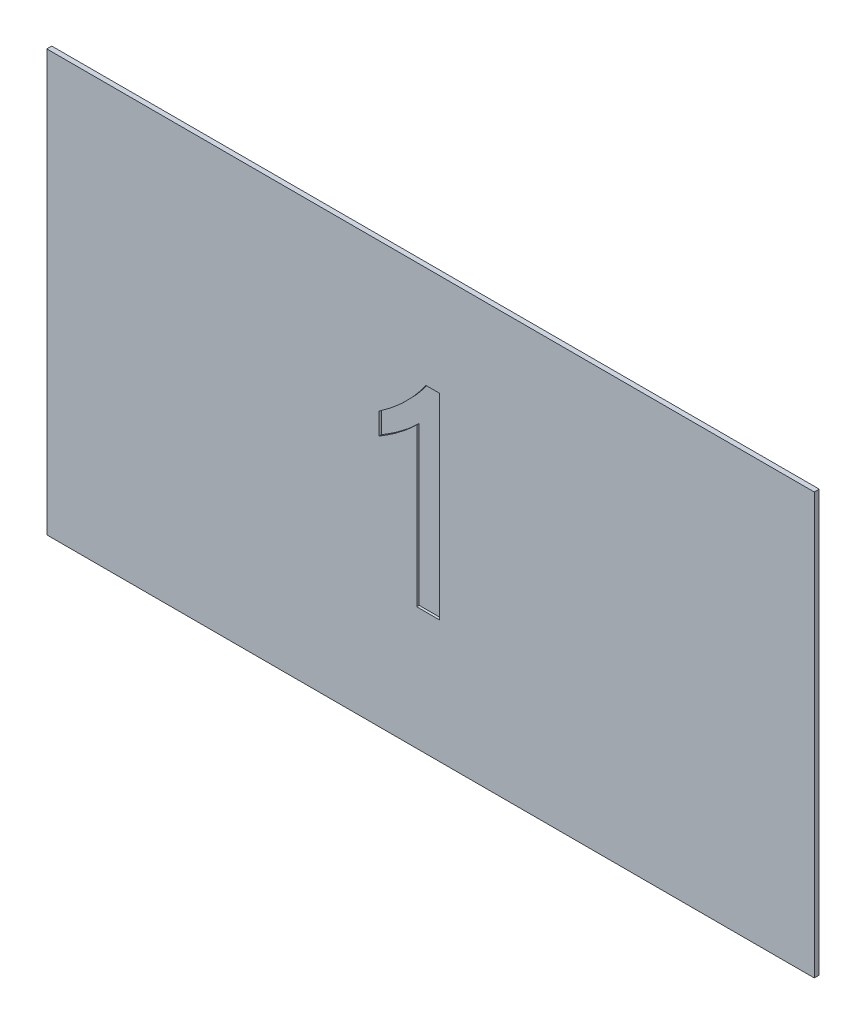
ISO-10303-21;
HEADER;
FILE_DESCRIPTION(('STEP AP214'),'2;1');
FILE_NAME('part.step','',(''),(''),'','','');
FILE_SCHEMA(('AUTOMOTIVE_DESIGN { 1 0 10303 214 1 1 1 1 }'));
ENDSEC;
DATA;
#1=APPLICATION_CONTEXT('core data for automotive mechanical design processes');
#2=APPLICATION_PROTOCOL_DEFINITION('international standard','automotive_design',2000,#1);
#3=PRODUCT_CONTEXT('',#1,'mechanical');
#4=PRODUCT('Part','Part','',(#3));
#5=PRODUCT_RELATED_PRODUCT_CATEGORY('part','',(#4));
#6=PRODUCT_DEFINITION_FORMATION('','',#4);
#7=PRODUCT_DEFINITION_CONTEXT('part definition',#1,'design');
#8=PRODUCT_DEFINITION('design','',#6,#7);
#9=PRODUCT_DEFINITION_SHAPE('','',#8);
#10=(LENGTH_UNIT() NAMED_UNIT(*) SI_UNIT(.MILLI.,.METRE.));
#11=(NAMED_UNIT(*) PLANE_ANGLE_UNIT() SI_UNIT($,.RADIAN.));
#12=(NAMED_UNIT(*) SI_UNIT($,.STERADIAN.) SOLID_ANGLE_UNIT());
#13=UNCERTAINTY_MEASURE_WITH_UNIT(LENGTH_MEASURE(1.E-05),#10,'distance_accuracy_value','');
#14=(GEOMETRIC_REPRESENTATION_CONTEXT(3) GLOBAL_UNCERTAINTY_ASSIGNED_CONTEXT((#13)) GLOBAL_UNIT_ASSIGNED_CONTEXT((#10,
#11,#12)) REPRESENTATION_CONTEXT('',''));
#15=CARTESIAN_POINT('',(0.,0.,0.));
#16=DIRECTION('',(0.,0.,1.));
#17=DIRECTION('',(1.,0.,0.));
#18=AXIS2_PLACEMENT_3D('',#15,#16,#17);
#19=CARTESIAN_POINT('',(-1.28168175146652,2.19572700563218,0.1));
#20=DIRECTION('',(0.,0.,1.));
#21=DIRECTION('',(0.,-1.,0.));
#22=AXIS2_PLACEMENT_3D('',#19,#20,#21);
#23=PLANE('',#22);
#24=DIRECTION('',(0.,1.,0.));
#25=VECTOR('',#24,1.);
#26=CARTESIAN_POINT('',(-2.07712958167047,1.66522913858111,0.1));
#27=LINE('',#26,#25);
#28=CARTESIAN_POINT('',(-2.07712958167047,1.66522913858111,0.1));
#29=VERTEX_POINT('',#28);
#30=CARTESIAN_POINT('',(-2.07712958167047,2.54104896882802,0.0999999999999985));
#31=VERTEX_POINT('',#30);
#32=EDGE_CURVE('E123',#29,#31,#27,.T.);
#33=ORIENTED_EDGE('',*,*,#32,.F.);
#34=CARTESIAN_POINT('',(-0.555968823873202,2.81762365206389,0.1));
#35=CARTESIAN_POINT('',(-0.567995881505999,2.80608477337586,0.1));
#36=CARTESIAN_POINT('',(-0.580022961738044,2.79454593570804,0.1));
#37=CARTESIAN_POINT('',(-0.604090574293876,2.7714831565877,0.1));
#38=CARTESIAN_POINT('',(-0.616131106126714,2.75995921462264,0.1));
#39=CARTESIAN_POINT('',(-0.64023969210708,2.73694039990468,0.1));
#40=CARTESIAN_POINT('',(-0.652307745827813,2.72544552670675,0.1));
#41=CARTESIAN_POINT('',(-0.676485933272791,2.70249938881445,0.1));
#42=CARTESIAN_POINT('',(-0.688596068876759,2.69104812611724,0.1));
#43=CARTESIAN_POINT('',(-0.749404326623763,2.63382017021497,0.1));
#44=CARTESIAN_POINT('',(-0.798515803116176,2.5884710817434,0.1));
#45=CARTESIAN_POINT('',(-0.873502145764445,2.52193253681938,0.1));
#46=CARTESIAN_POINT('',(-0.898717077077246,2.50000084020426,0.1));
#47=CARTESIAN_POINT('',(-0.949582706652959,2.45664865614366,0.1));
#48=CARTESIAN_POINT('',(-0.97523341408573,2.43522817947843,0.1));
#49=CARTESIAN_POINT('',(-1.05275322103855,2.37162034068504,0.1));
#50=CARTESIAN_POINT('',(-1.10517217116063,2.3301022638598,0.1));
#51=CARTESIAN_POINT('',(-1.18458577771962,2.26884597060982,0.1));
#52=CARTESIAN_POINT('',(-1.21119006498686,2.24859571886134,0.1));
#53=CARTESIAN_POINT('',(-1.26461194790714,2.20837828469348,0.1));
#54=CARTESIAN_POINT('',(-1.29142954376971,2.18841110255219,0.1));
#55=CARTESIAN_POINT('',(-1.379524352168,2.12357692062,0.1));
#56=CARTESIAN_POINT('',(-1.44126136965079,2.07933042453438,0.1));
#57=CARTESIAN_POINT('',(-1.53474939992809,2.01423605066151,0.0999999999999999));
#58=CARTESIAN_POINT('',(-1.56605860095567,1.99275085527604,0.0999999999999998));
#59=CARTESIAN_POINT('',(-1.62898675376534,1.95023862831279,0.0999999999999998));
#60=CARTESIAN_POINT('',(-1.66060570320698,1.92921159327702,0.0999999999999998));
#61=CARTESIAN_POINT('',(-1.75579309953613,1.86678310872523,0.0999999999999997));
#62=CARTESIAN_POINT('',(-1.81975753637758,1.8259889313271,0.0999999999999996));
#63=CARTESIAN_POINT('',(-1.94819726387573,1.74520724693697,0.0999999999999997));
#64=CARTESIAN_POINT('',(-2.01267256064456,1.70521974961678,0.0999999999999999));
#65=CARTESIAN_POINT('',(-2.07712958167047,1.66522913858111,0.100000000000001));
#66=B_SPLINE_CURVE_WITH_KNOTS('',3,(#34,#35,#36,#37,#38,#39,#40,#41,#42,#43,#44,#45,#46,#47,#48,
#49,#50,#51,#52,#53,#54,#55,#56,#57,#58,#59,#60,#61,#62,#63,#64,#65),.UNSPECIFIED.,.F.,.F.,(4,2,
2,2,2,2,2,2,2,2,2,2,2,2,2,4),(0.,0.05000159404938,0.100001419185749,0.150000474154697,
0.200001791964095,0.400503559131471,0.500751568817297,0.601001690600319,0.80157316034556,
0.901875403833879,1.00217774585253,1.23001232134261,1.34392559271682,1.45783800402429,
1.68542406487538,1.9130128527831),.UNSPECIFIED.);
#67=CARTESIAN_POINT('',(-0.555968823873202,2.81762365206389,0.1));
#68=VERTEX_POINT('',#67);
#69=EDGE_CURVE('E24',#68,#29,#66,.T.);
#70=ORIENTED_EDGE('',*,*,#69,.F.);
#71=DIRECTION('',(0.,1.,0.));
#72=VECTOR('',#71,1.);
#73=CARTESIAN_POINT('',(-0.555968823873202,-3.54359406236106,0.1));
#74=LINE('',#73,#72);
#75=CARTESIAN_POINT('',(-0.555968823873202,-3.54359406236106,0.1));
#76=VERTEX_POINT('',#75);
#77=EDGE_CURVE('E106',#76,#68,#74,.T.);
#78=ORIENTED_EDGE('',*,*,#77,.F.);
#79=DIRECTION('',(1.,0.,0.));
#80=VECTOR('',#79,1.);
#81=CARTESIAN_POINT('',(0.365946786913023,-3.54359406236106,0.1));
#82=LINE('',#81,#80);
#83=CARTESIAN_POINT('',(0.365946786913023,-3.54359406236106,0.1));
#84=VERTEX_POINT('',#83);
#85=EDGE_CURVE('E211',#84,#76,#82,.F.);
#86=ORIENTED_EDGE('',*,*,#85,.F.);
#87=DIRECTION('',(0.,1.,0.));
#88=VECTOR('',#87,1.);
#89=CARTESIAN_POINT('',(0.365946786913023,4.38488019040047,0.1));
#90=LINE('',#89,#88);
#91=CARTESIAN_POINT('',(0.365946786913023,4.38488019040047,0.1));
#92=VERTEX_POINT('',#91);
#93=EDGE_CURVE('E200',#92,#84,#90,.F.);
#94=ORIENTED_EDGE('',*,*,#93,.F.);
#95=DIRECTION('',(1.,0.,0.));
#96=VECTOR('',#95,1.);
#97=CARTESIAN_POINT('',(-0.187202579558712,4.38488019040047,0.1));
#98=LINE('',#97,#96);
#99=CARTESIAN_POINT('',(-0.187202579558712,4.38488019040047,0.100000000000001));
#100=VERTEX_POINT('',#99);
#101=EDGE_CURVE('E190',#100,#92,#98,.T.);
#102=ORIENTED_EDGE('',*,*,#101,.F.);
#103=CARTESIAN_POINT('',(-2.07712958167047,2.54104896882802,0.100000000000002));
#104=CARTESIAN_POINT('',(-2.06343061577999,2.5505390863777,0.0999999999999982));
#105=CARTESIAN_POINT('',(-2.04973167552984,2.56002927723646,0.0999999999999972));
#106=CARTESIAN_POINT('',(-2.02234628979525,2.57902889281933,0.0999999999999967));
#107=CARTESIAN_POINT('',(-2.00865984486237,2.58853831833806,0.0999999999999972));
#108=CARTESIAN_POINT('',(-1.98131078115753,2.6075962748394,0.0999999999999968));
#109=CARTESIAN_POINT('',(-1.96764816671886,2.61714481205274,0.0999999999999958));
#110=CARTESIAN_POINT('',(-1.94036324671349,2.63629845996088,0.0999999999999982));
#111=CARTESIAN_POINT('',(-1.92674094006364,2.64590356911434,0.100000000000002));
#112=CARTESIAN_POINT('',(-1.88590382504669,2.6748623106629,0.100000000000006));
#113=CARTESIAN_POINT('',(-1.85876668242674,2.69432618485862,0.0999999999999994));
#114=CARTESIAN_POINT('',(-1.80483481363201,2.73372255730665,0.0999999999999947));
#115=CARTESIAN_POINT('',(-1.77804007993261,2.75365504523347,0.0999999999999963));
#116=CARTESIAN_POINT('',(-1.69818236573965,2.81416552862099,0.0999999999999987));
#117=CARTESIAN_POINT('',(-1.64565526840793,2.85544993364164,0.0999999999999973));
#118=CARTESIAN_POINT('',(-1.56750303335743,2.91816420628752,0.099999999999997));
#119=CARTESIAN_POINT('',(-1.54155748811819,2.93920124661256,0.0999999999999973));
#120=CARTESIAN_POINT('',(-1.48982944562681,2.98147474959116,0.0999999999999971));
#121=CARTESIAN_POINT('',(-1.46404694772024,3.00271121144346,0.0999999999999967));
#122=CARTESIAN_POINT('',(-1.38706428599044,3.06684467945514,0.0999999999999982));
#123=CARTESIAN_POINT('',(-1.33621880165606,3.11017384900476,0.100000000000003));
#124=CARTESIAN_POINT('',(-1.23493514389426,3.19973078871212,0.100000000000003));
#125=CARTESIAN_POINT('',(-1.18453644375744,3.24600328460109,0.0999999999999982));
#126=CARTESIAN_POINT('',(-1.10991331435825,3.31644095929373,0.0999999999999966));
#127=CARTESIAN_POINT('',(-1.0851991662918,3.34009392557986,0.099999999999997));
#128=CARTESIAN_POINT('',(-1.03600585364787,3.38764300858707,0.0999999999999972));
#129=CARTESIAN_POINT('',(-1.01152669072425,3.41153912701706,0.0999999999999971));
#130=CARTESIAN_POINT('',(-0.938472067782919,3.48361186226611,0.0999999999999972));
#131=CARTESIAN_POINT('',(-0.890274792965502,3.53217728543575,0.099999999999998));
#132=CARTESIAN_POINT('',(-0.819276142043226,3.60626497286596,0.0999999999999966));
#133=CARTESIAN_POINT('',(-0.795827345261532,3.6311661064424,0.0999999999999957));
#134=CARTESIAN_POINT('',(-0.749401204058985,3.68140397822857,0.0999999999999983));
#135=CARTESIAN_POINT('',(-0.726423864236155,3.70674072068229,0.100000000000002));
#136=CARTESIAN_POINT('',(-0.657446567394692,3.78401306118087,0.100000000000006));
#137=CARTESIAN_POINT('',(-0.612071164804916,3.83650658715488,0.0999999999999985));
#138=CARTESIAN_POINT('',(-0.544965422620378,3.91605547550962,0.0999999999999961));
#139=CARTESIAN_POINT('',(-0.522754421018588,3.94270900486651,0.0999999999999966));
#140=CARTESIAN_POINT('',(-0.478746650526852,3.99635414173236,0.099999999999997));
#141=CARTESIAN_POINT('',(-0.456949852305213,4.02334572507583,0.0999999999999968));
#142=CARTESIAN_POINT('',(-0.413840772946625,4.07773207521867,0.0999999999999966));
#143=CARTESIAN_POINT('',(-0.39252869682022,4.10512700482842,0.0999999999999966));
#144=CARTESIAN_POINT('',(-0.350460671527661,4.16034388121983,0.0999999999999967));
#145=CARTESIAN_POINT('',(-0.329704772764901,4.18816586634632,0.0999999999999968));
#146=CARTESIAN_POINT('',(-0.288563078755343,4.2440723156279,0.0999999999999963));
#147=CARTESIAN_POINT('',(-0.268177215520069,4.27215673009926,0.0999999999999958));
#148=CARTESIAN_POINT('',(-0.227594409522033,4.328454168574,0.0999999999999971));
#149=CARTESIAN_POINT('',(-0.207397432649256,4.35666716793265,0.099999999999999));
#150=CARTESIAN_POINT('',(-0.187202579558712,4.38488019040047,0.100000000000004));
#151=B_SPLINE_CURVE_WITH_KNOTS('',3,(#103,#104,#105,#106,#107,#108,#109,#110,#111,#112,#113,
#114,#115,#116,#117,#118,#119,#120,#121,#122,#123,#124,#125,#126,#127,#128,#129,#130,#131,#132,
#133,#134,#135,#136,#137,#138,#139,#140,#141,#142,#143,#144,#145,#146,#147,#148,#149,#150),
.UNSPECIFIED.,.F.,.F.,(4,2,2,2,2,2,2,2,2,2,2,2,2,2,2,2,2,2,2,2,2,2,2,4),(0.,0.049995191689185,
0.099992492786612,0.149998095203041,0.200002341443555,0.300185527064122,0.400366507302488,
0.60076291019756,0.700970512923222,0.801177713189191,1.00155319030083,1.20676651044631,
1.3093923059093,1.4120188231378,1.61725253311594,1.71985849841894,1.82246546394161,
2.03059355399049,2.13467657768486,2.23875220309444,2.34287105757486,2.44699931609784,
2.5511082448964,2.65519799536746),.UNSPECIFIED.);
#152=EDGE_CURVE('E129',#31,#100,#151,.T.);
#153=ORIENTED_EDGE('',*,*,#152,.F.);
#154=EDGE_LOOP('',(#33,#70,#78,#86,#94,#102,#153));
#155=FACE_BOUND('',#154,.T.);
#156=ADVANCED_FACE('F17',(#155),#23,.T.);
#157=CARTESIAN_POINT('',(0.365946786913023,-3.54359406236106,0.1));
#158=DIRECTION('',(0.,1.,0.));
#159=DIRECTION('',(0.,0.,1.));
#160=AXIS2_PLACEMENT_3D('',#157,#158,#159);
#161=PLANE('',#160);
#162=ORIENTED_EDGE('',*,*,#85,.T.);
#163=DIRECTION('',(0.,0.,-1.));
#164=VECTOR('',#163,1.);
#165=CARTESIAN_POINT('',(-0.555968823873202,-3.54359406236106,0.1));
#166=LINE('',#165,#164);
#167=CARTESIAN_POINT('',(-0.555968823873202,-3.54359406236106,0.2));
#168=VERTEX_POINT('',#167);
#169=EDGE_CURVE('E138',#168,#76,#166,.T.);
#170=ORIENTED_EDGE('',*,*,#169,.F.);
#171=DIRECTION('',(1.,0.,0.));
#172=VECTOR('',#171,1.);
#173=CARTESIAN_POINT('',(0.,-3.54359406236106,0.2));
#174=LINE('',#173,#172);
#175=CARTESIAN_POINT('',(0.365946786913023,-3.54359406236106,0.2));
#176=VERTEX_POINT('',#175);
#177=EDGE_CURVE('E214',#176,#168,#174,.F.);
#178=ORIENTED_EDGE('',*,*,#177,.F.);
#179=DIRECTION('',(0.,0.,1.));
#180=VECTOR('',#179,1.);
#181=CARTESIAN_POINT('',(0.365946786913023,-3.54359406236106,0.1));
#182=LINE('',#181,#180);
#183=EDGE_CURVE('E217',#84,#176,#182,.T.);
#184=ORIENTED_EDGE('',*,*,#183,.F.);
#185=EDGE_LOOP('',(#162,#170,#178,#184));
#186=FACE_BOUND('',#185,.T.);
#187=ADVANCED_FACE('F174',(#186),#161,.T.);
#188=CARTESIAN_POINT('',(-0.555968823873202,-3.54359406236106,0.1));
#189=DIRECTION('',(1.,0.,0.));
#190=DIRECTION('',(0.,0.,-1.));
#191=AXIS2_PLACEMENT_3D('',#188,#189,#190);
#192=PLANE('',#191);
#193=ORIENTED_EDGE('',*,*,#77,.T.);
#194=DIRECTION('',(0.,0.,-1.));
#195=VECTOR('',#194,1.);
#196=CARTESIAN_POINT('',(-0.555968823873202,2.81762365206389,0.15));
#197=LINE('',#196,#195);
#198=CARTESIAN_POINT('',(-0.555968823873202,2.81762365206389,0.2));
#199=VERTEX_POINT('',#198);
#200=EDGE_CURVE('E117',#199,#68,#197,.T.);
#201=ORIENTED_EDGE('',*,*,#200,.F.);
#202=DIRECTION('',(0.,1.,0.));
#203=VECTOR('',#202,1.);
#204=CARTESIAN_POINT('',(-0.555968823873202,0.,0.2));
#205=LINE('',#204,#203);
#206=EDGE_CURVE('E216',#168,#199,#205,.T.);
#207=ORIENTED_EDGE('',*,*,#206,.F.);
#208=ORIENTED_EDGE('',*,*,#169,.T.);
#209=EDGE_LOOP('',(#193,#201,#207,#208));
#210=FACE_BOUND('',#209,.T.);
#211=ADVANCED_FACE('F171',(#210),#192,.T.);
#212=CARTESIAN_POINT('',(-0.555968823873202,2.81762365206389,0.1));
#213=CARTESIAN_POINT('',(-0.555968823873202,2.81762365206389,0.2));
#214=CARTESIAN_POINT('',(-0.660914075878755,2.71693850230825,0.1));
#215=CARTESIAN_POINT('',(-0.660914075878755,2.71693850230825,0.2));
#216=CARTESIAN_POINT('',(-0.877186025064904,2.50944580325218,0.1));
#217=CARTESIAN_POINT('',(-0.877186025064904,2.50944580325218,0.2));
#218=CARTESIAN_POINT('',(-1.24095905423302,2.22113704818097,0.1));
#219=CARTESIAN_POINT('',(-1.24095905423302,2.22113704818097,0.2));
#220=CARTESIAN_POINT('',(-1.64190719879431,1.93518667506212,0.0999999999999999));
#221=CARTESIAN_POINT('',(-1.64190719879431,1.93518667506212,0.2));
#222=CARTESIAN_POINT('',(-1.92924702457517,1.75695698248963,0.1));
#223=CARTESIAN_POINT('',(-1.92924702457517,1.75695698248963,0.2));
#224=CARTESIAN_POINT('',(-2.07712958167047,1.66522913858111,0.1));
#225=CARTESIAN_POINT('',(-2.07712958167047,1.66522913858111,0.2));
#226=B_SPLINE_SURFACE_WITH_KNOTS('',3,1,((#212,#213),(#214,#215),(#216,#217),(#218,#219),(#220,
#221),(#222,#223),(#224,#225)),.UNSPECIFIED.,.F.,.F.,.F.,(4,1,1,1,4),(2,2),(0.,0.22798169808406,
0.469826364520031,0.727140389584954,1.),(0.,1.),.UNSPECIFIED.);
#227=DIRECTION('',(0.,0.,-1.));
#228=VECTOR('',#227,1.);
#229=CARTESIAN_POINT('',(-2.07712958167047,1.66522913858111,0.1));
#230=LINE('',#229,#228);
#231=CARTESIAN_POINT('',(-2.07712958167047,1.66522913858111,0.2));
#232=VERTEX_POINT('',#231);
#233=EDGE_CURVE('E115',#232,#29,#230,.T.);
#234=CARTESIAN_POINT('',(-0.555968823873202,2.81762365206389,0.2));
#235=CARTESIAN_POINT('',(-0.567995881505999,2.80608477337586,0.2));
#236=CARTESIAN_POINT('',(-0.580022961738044,2.79454593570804,0.2));
#237=CARTESIAN_POINT('',(-0.604090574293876,2.7714831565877,0.2));
#238=CARTESIAN_POINT('',(-0.616131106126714,2.75995921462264,0.2));
#239=CARTESIAN_POINT('',(-0.640239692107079,2.73694039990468,0.2));
#240=CARTESIAN_POINT('',(-0.652307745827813,2.72544552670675,0.2));
#241=CARTESIAN_POINT('',(-0.67648593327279,2.70249938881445,0.2));
#242=CARTESIAN_POINT('',(-0.688596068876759,2.69104812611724,0.2));
#243=CARTESIAN_POINT('',(-0.749404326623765,2.63382017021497,0.2));
#244=CARTESIAN_POINT('',(-0.798515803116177,2.5884710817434,0.2));
#245=CARTESIAN_POINT('',(-0.873502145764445,2.52193253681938,0.2));
#246=CARTESIAN_POINT('',(-0.898717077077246,2.50000084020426,0.2));
#247=CARTESIAN_POINT('',(-0.949582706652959,2.45664865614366,0.2));
#248=CARTESIAN_POINT('',(-0.97523341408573,2.43522817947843,0.2));
#249=CARTESIAN_POINT('',(-1.05275322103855,2.37162034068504,0.2));
#250=CARTESIAN_POINT('',(-1.10517217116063,2.3301022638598,0.2));
#251=CARTESIAN_POINT('',(-1.18458577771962,2.26884597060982,0.2));
#252=CARTESIAN_POINT('',(-1.21119006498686,2.24859571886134,0.2));
#253=CARTESIAN_POINT('',(-1.26461194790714,2.20837828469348,0.2));
#254=CARTESIAN_POINT('',(-1.29142954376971,2.18841110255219,0.2));
#255=CARTESIAN_POINT('',(-1.379524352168,2.12357692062,0.2));
#256=CARTESIAN_POINT('',(-1.44126136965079,2.07933042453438,0.2));
#257=CARTESIAN_POINT('',(-1.53474939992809,2.01423605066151,0.2));
#258=CARTESIAN_POINT('',(-1.56605860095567,1.99275085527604,0.2));
#259=CARTESIAN_POINT('',(-1.62898675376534,1.95023862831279,0.2));
#260=CARTESIAN_POINT('',(-1.66060570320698,1.92921159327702,0.2));
#261=CARTESIAN_POINT('',(-1.75579309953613,1.86678310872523,0.2));
#262=CARTESIAN_POINT('',(-1.81975753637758,1.8259889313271,0.2));
#263=CARTESIAN_POINT('',(-1.94819726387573,1.74520724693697,0.2));
#264=CARTESIAN_POINT('',(-2.01267256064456,1.70521974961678,0.2));
#265=CARTESIAN_POINT('',(-2.07712958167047,1.66522913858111,0.2));
#266=B_SPLINE_CURVE_WITH_KNOTS('',3,(#234,#235,#236,#237,#238,#239,#240,#241,#242,#243,#244,
#245,#246,#247,#248,#249,#250,#251,#252,#253,#254,#255,#256,#257,#258,#259,#260,#261,#262,#263,
#264,#265),.UNSPECIFIED.,.F.,.F.,(4,2,2,2,2,2,2,2,2,2,2,2,2,2,2,4),(0.,0.05000159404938,
0.100001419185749,0.150000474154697,0.200001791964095,0.400503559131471,0.500751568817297,
0.60100169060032,0.80157316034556,0.901875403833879,1.00217774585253,1.23001232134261,
1.34392559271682,1.45783800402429,1.68542406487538,1.9130128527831),.UNSPECIFIED.);
#267=EDGE_CURVE('E148',#199,#232,#266,.T.);
#268=ORIENTED_EDGE('',*,*,#69,.T.);
#269=ORIENTED_EDGE('',*,*,#233,.F.);
#270=ORIENTED_EDGE('',*,*,#267,.F.);
#271=ORIENTED_EDGE('',*,*,#200,.T.);
#272=EDGE_LOOP('',(#268,#269,#270,#271));
#273=FACE_BOUND('',#272,.T.);
#274=ADVANCED_FACE('F113',(#273),#226,.T.);
#275=CARTESIAN_POINT('',(-2.07712958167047,1.66522913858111,0.1));
#276=DIRECTION('',(1.,0.,0.));
#277=DIRECTION('',(0.,0.,-1.));
#278=AXIS2_PLACEMENT_3D('',#275,#276,#277);
#279=PLANE('',#278);
#280=ORIENTED_EDGE('',*,*,#32,.T.);
#281=DIRECTION('',(0.,0.,-1.));
#282=VECTOR('',#281,1.);
#283=CARTESIAN_POINT('',(-2.07712958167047,2.54104896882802,0.15));
#284=LINE('',#283,#282);
#285=CARTESIAN_POINT('',(-2.07712958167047,2.54104896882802,0.2));
#286=VERTEX_POINT('',#285);
#287=EDGE_CURVE('E130',#286,#31,#284,.T.);
#288=ORIENTED_EDGE('',*,*,#287,.F.);
#289=DIRECTION('',(0.,1.,0.));
#290=VECTOR('',#289,1.);
#291=CARTESIAN_POINT('',(-2.07712958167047,0.,0.2));
#292=LINE('',#291,#290);
#293=EDGE_CURVE('E125',#232,#286,#292,.T.);
#294=ORIENTED_EDGE('',*,*,#293,.F.);
#295=ORIENTED_EDGE('',*,*,#233,.T.);
#296=EDGE_LOOP('',(#280,#288,#294,#295));
#297=FACE_BOUND('',#296,.T.);
#298=ADVANCED_FACE('F121',(#297),#279,.T.);
#299=CARTESIAN_POINT('',(-2.07712958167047,2.54104896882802,0.1));
#300=CARTESIAN_POINT('',(-2.07712958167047,2.54104896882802,0.2));
#301=CARTESIAN_POINT('',(-1.98248192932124,2.60661765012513,0.1));
#302=CARTESIAN_POINT('',(-1.98248192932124,2.60661765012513,0.2));
#303=CARTESIAN_POINT('',(-1.79450984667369,2.73683832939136,0.1));
#304=CARTESIAN_POINT('',(-1.79450984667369,2.73683832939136,0.2));
#305=CARTESIAN_POINT('',(-1.52776720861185,2.94864122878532,0.1));
#306=CARTESIAN_POINT('',(-1.52776720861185,2.94864122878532,0.2));
#307=CARTESIAN_POINT('',(-1.26987959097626,3.16430194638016,0.1));
#308=CARTESIAN_POINT('',(-1.26987959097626,3.16430194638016,0.2));
#309=CARTESIAN_POINT('',(-1.02864543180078,3.39262911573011,0.1));
#310=CARTESIAN_POINT('',(-1.02864543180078,3.39262911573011,0.2));
#311=CARTESIAN_POINT('',(-0.796393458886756,3.62583901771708,0.1));
#312=CARTESIAN_POINT('',(-0.796393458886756,3.62583901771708,0.2));
#313=CARTESIAN_POINT('',(-0.580816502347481,3.87046710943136,0.1));
#314=CARTESIAN_POINT('',(-0.580816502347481,3.87046710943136,0.2));
#315=CARTESIAN_POINT('',(-0.375516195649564,4.12181726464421,0.1));
#316=CARTESIAN_POINT('',(-0.375516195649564,4.12181726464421,0.2));
#317=CARTESIAN_POINT('',(-0.250027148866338,4.29711800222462,0.1));
#318=CARTESIAN_POINT('',(-0.250027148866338,4.29711800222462,0.2));
#319=CARTESIAN_POINT('',(-0.187202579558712,4.38488019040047,0.1));
#320=CARTESIAN_POINT('',(-0.187202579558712,4.38488019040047,0.2));
#321=B_SPLINE_SURFACE_WITH_KNOTS('',3,1,((#299,#300),(#301,#302),(#303,#304),(#305,#306),(#307,
#308),(#309,#310),(#311,#312),(#313,#314),(#315,#316),(#317,#318),(#319,#320)),.UNSPECIFIED.,
.F.,.F.,.F.,(4,1,1,1,1,1,1,1,4),(2,2),(0.,0.130065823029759,0.258313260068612,0.384694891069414,
0.509800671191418,0.633478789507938,0.756459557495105,0.878074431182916,1.),(0.,1.),.UNSPECIFIED.);
#322=DIRECTION('',(0.,0.,-1.));
#323=VECTOR('',#322,1.);
#324=CARTESIAN_POINT('',(-0.187202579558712,4.38488019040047,0.1));
#325=LINE('',#324,#323);
#326=CARTESIAN_POINT('',(-0.187202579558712,4.38488019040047,0.2));
#327=VERTEX_POINT('',#326);
#328=EDGE_CURVE('E186',#327,#100,#325,.T.);
#329=CARTESIAN_POINT('',(-2.07712958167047,2.54104896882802,0.2));
#330=CARTESIAN_POINT('',(-2.06343061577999,2.5505390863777,0.2));
#331=CARTESIAN_POINT('',(-2.04973167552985,2.56002927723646,0.2));
#332=CARTESIAN_POINT('',(-2.02234628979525,2.57902889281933,0.2));
#333=CARTESIAN_POINT('',(-2.00865984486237,2.58853831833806,0.2));
#334=CARTESIAN_POINT('',(-1.98131078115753,2.6075962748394,0.2));
#335=CARTESIAN_POINT('',(-1.96764816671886,2.61714481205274,0.2));
#336=CARTESIAN_POINT('',(-1.94036324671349,2.63629845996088,0.2));
#337=CARTESIAN_POINT('',(-1.92674094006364,2.64590356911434,0.2));
#338=CARTESIAN_POINT('',(-1.88590382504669,2.6748623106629,0.2));
#339=CARTESIAN_POINT('',(-1.85876668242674,2.69432618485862,0.2));
#340=CARTESIAN_POINT('',(-1.80483481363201,2.73372255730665,0.2));
#341=CARTESIAN_POINT('',(-1.77804007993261,2.75365504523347,0.2));
#342=CARTESIAN_POINT('',(-1.69818236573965,2.81416552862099,0.2));
#343=CARTESIAN_POINT('',(-1.64565526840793,2.85544993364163,0.2));
#344=CARTESIAN_POINT('',(-1.56750303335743,2.91816420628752,0.2));
#345=CARTESIAN_POINT('',(-1.54155748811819,2.93920124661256,0.2));
#346=CARTESIAN_POINT('',(-1.48982944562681,2.98147474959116,0.2));
#347=CARTESIAN_POINT('',(-1.46404694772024,3.00271121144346,0.2));
#348=CARTESIAN_POINT('',(-1.38706428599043,3.06684467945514,0.2));
#349=CARTESIAN_POINT('',(-1.33621880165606,3.11017384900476,0.2));
#350=CARTESIAN_POINT('',(-1.23493514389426,3.19973078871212,0.2));
#351=CARTESIAN_POINT('',(-1.18453644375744,3.24600328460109,0.2));
#352=CARTESIAN_POINT('',(-1.10991331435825,3.31644095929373,0.2));
#353=CARTESIAN_POINT('',(-1.0851991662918,3.34009392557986,0.2));
#354=CARTESIAN_POINT('',(-1.03600585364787,3.38764300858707,0.2));
#355=CARTESIAN_POINT('',(-1.01152669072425,3.41153912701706,0.2));
#356=CARTESIAN_POINT('',(-0.938472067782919,3.48361186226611,0.2));
#357=CARTESIAN_POINT('',(-0.890274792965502,3.53217728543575,0.2));
#358=CARTESIAN_POINT('',(-0.819276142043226,3.60626497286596,0.2));
#359=CARTESIAN_POINT('',(-0.795827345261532,3.6311661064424,0.2));
#360=CARTESIAN_POINT('',(-0.749401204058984,3.68140397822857,0.2));
#361=CARTESIAN_POINT('',(-0.726423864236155,3.70674072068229,0.2));
#362=CARTESIAN_POINT('',(-0.657446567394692,3.78401306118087,0.2));
#363=CARTESIAN_POINT('',(-0.612071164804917,3.83650658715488,0.2));
#364=CARTESIAN_POINT('',(-0.544965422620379,3.91605547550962,0.2));
#365=CARTESIAN_POINT('',(-0.522754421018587,3.94270900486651,0.2));
#366=CARTESIAN_POINT('',(-0.478746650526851,3.99635414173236,0.2));
#367=CARTESIAN_POINT('',(-0.456949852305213,4.02334572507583,0.2));
#368=CARTESIAN_POINT('',(-0.413840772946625,4.07773207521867,0.2));
#369=CARTESIAN_POINT('',(-0.39252869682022,4.10512700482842,0.2));
#370=CARTESIAN_POINT('',(-0.350460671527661,4.16034388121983,0.2));
#371=CARTESIAN_POINT('',(-0.329704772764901,4.18816586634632,0.2));
#372=CARTESIAN_POINT('',(-0.288563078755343,4.2440723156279,0.2));
#373=CARTESIAN_POINT('',(-0.268177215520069,4.27215673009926,0.2));
#374=CARTESIAN_POINT('',(-0.227594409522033,4.328454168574,0.2));
#375=CARTESIAN_POINT('',(-0.207397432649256,4.35666716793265,0.2));
#376=CARTESIAN_POINT('',(-0.187202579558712,4.38488019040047,0.2));
#377=B_SPLINE_CURVE_WITH_KNOTS('',3,(#329,#330,#331,#332,#333,#334,#335,#336,#337,#338,#339,
#340,#341,#342,#343,#344,#345,#346,#347,#348,#349,#350,#351,#352,#353,#354,#355,#356,#357,#358,
#359,#360,#361,#362,#363,#364,#365,#366,#367,#368,#369,#370,#371,#372,#373,#374,#375,#376),
.UNSPECIFIED.,.F.,.F.,(4,2,2,2,2,2,2,2,2,2,2,2,2,2,2,2,2,2,2,2,2,2,2,4),(0.,0.0499951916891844,
0.0999924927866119,0.149998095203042,0.200002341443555,0.300185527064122,0.400366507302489,
0.60076291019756,0.700970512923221,0.801177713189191,1.00155319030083,1.20676651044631,
1.3093923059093,1.41201882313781,1.61725253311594,1.71985849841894,1.82246546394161,
2.03059355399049,2.13467657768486,2.23875220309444,2.34287105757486,2.44699931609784,
2.5511082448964,2.65519799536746),.UNSPECIFIED.);
#378=EDGE_CURVE('E141',#286,#327,#377,.T.);
#379=ORIENTED_EDGE('',*,*,#152,.T.);
#380=ORIENTED_EDGE('',*,*,#328,.F.);
#381=ORIENTED_EDGE('',*,*,#378,.F.);
#382=ORIENTED_EDGE('',*,*,#287,.T.);
#383=EDGE_LOOP('',(#379,#380,#381,#382));
#384=FACE_BOUND('',#383,.T.);
#385=ADVANCED_FACE('F19',(#384),#321,.T.);
#386=CARTESIAN_POINT('',(-0.187202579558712,4.38488019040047,0.1));
#387=DIRECTION('',(0.,-1.,0.));
#388=DIRECTION('',(0.,0.,-1.));
#389=AXIS2_PLACEMENT_3D('',#386,#387,#388);
#390=PLANE('',#389);
#391=ORIENTED_EDGE('',*,*,#101,.T.);
#392=DIRECTION('',(0.,0.,1.));
#393=VECTOR('',#392,1.);
#394=CARTESIAN_POINT('',(0.365946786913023,4.38488019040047,0.1));
#395=LINE('',#394,#393);
#396=CARTESIAN_POINT('',(0.365946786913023,4.38488019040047,0.2));
#397=VERTEX_POINT('',#396);
#398=EDGE_CURVE('E193',#397,#92,#395,.F.);
#399=ORIENTED_EDGE('',*,*,#398,.F.);
#400=DIRECTION('',(1.,0.,0.));
#401=VECTOR('',#400,1.);
#402=CARTESIAN_POINT('',(0.,4.38488019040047,0.2));
#403=LINE('',#402,#401);
#404=EDGE_CURVE('E147',#327,#397,#403,.T.);
#405=ORIENTED_EDGE('',*,*,#404,.F.);
#406=ORIENTED_EDGE('',*,*,#328,.T.);
#407=EDGE_LOOP('',(#391,#399,#405,#406));
#408=FACE_BOUND('',#407,.T.);
#409=ADVANCED_FACE('F164',(#408),#390,.T.);
#410=CARTESIAN_POINT('',(0.365946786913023,4.38488019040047,0.1));
#411=DIRECTION('',(-1.,0.,0.));
#412=DIRECTION('',(0.,0.,1.));
#413=AXIS2_PLACEMENT_3D('',#410,#411,#412);
#414=PLANE('',#413);
#415=ORIENTED_EDGE('',*,*,#93,.T.);
#416=ORIENTED_EDGE('',*,*,#183,.T.);
#417=DIRECTION('',(0.,1.,0.));
#418=VECTOR('',#417,1.);
#419=CARTESIAN_POINT('',(0.365946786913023,0.,0.2));
#420=LINE('',#419,#418);
#421=EDGE_CURVE('E203',#397,#176,#420,.F.);
#422=ORIENTED_EDGE('',*,*,#421,.F.);
#423=ORIENTED_EDGE('',*,*,#398,.T.);
#424=EDGE_LOOP('',(#415,#416,#422,#423));
#425=FACE_BOUND('',#424,.T.);
#426=ADVANCED_FACE('F158',(#425),#414,.T.);
#427=CARTESIAN_POINT('',(0.,0.,0.2));
#428=DIRECTION('',(0.,0.,1.));
#429=DIRECTION('',(1.,0.,0.));
#430=AXIS2_PLACEMENT_3D('',#427,#428,#429);
#431=PLANE('',#430);
#432=ORIENTED_EDGE('',*,*,#404,.T.);
#433=ORIENTED_EDGE('',*,*,#421,.T.);
#434=ORIENTED_EDGE('',*,*,#177,.T.);
#435=ORIENTED_EDGE('',*,*,#206,.T.);
#436=ORIENTED_EDGE('',*,*,#267,.T.);
#437=ORIENTED_EDGE('',*,*,#293,.T.);
#438=ORIENTED_EDGE('',*,*,#378,.T.);
#439=EDGE_LOOP('',(#432,#433,#434,#435,#436,#437,#438));
#440=FACE_BOUND('',#439,.T.);
#441=DIRECTION('',(0.,1.,0.));
#442=VECTOR('',#441,1.);
#443=CARTESIAN_POINT('',(-15.5,8.5,0.2));
#444=LINE('',#443,#442);
#445=CARTESIAN_POINT('',(-15.5,8.5,0.2));
#446=VERTEX_POINT('',#445);
#447=CARTESIAN_POINT('',(-15.5,-8.5,0.2));
#448=VERTEX_POINT('',#447);
#449=EDGE_CURVE('E273',#446,#448,#444,.F.);
#450=ORIENTED_EDGE('',*,*,#449,.T.);
#451=DIRECTION('',(1.,0.,0.));
#452=VECTOR('',#451,1.);
#453=CARTESIAN_POINT('',(-15.5,-8.5,0.2));
#454=LINE('',#453,#452);
#455=CARTESIAN_POINT('',(15.5,-8.5,0.2));
#456=VERTEX_POINT('',#455);
#457=EDGE_CURVE('E279',#448,#456,#454,.T.);
#458=ORIENTED_EDGE('',*,*,#457,.T.);
#459=DIRECTION('',(0.,-1.,0.));
#460=VECTOR('',#459,1.);
#461=CARTESIAN_POINT('',(15.5,8.5,0.2));
#462=LINE('',#461,#460);
#463=CARTESIAN_POINT('',(15.5,8.5,0.2));
#464=VERTEX_POINT('',#463);
#465=EDGE_CURVE('E287',#456,#464,#462,.F.);
#466=ORIENTED_EDGE('',*,*,#465,.T.);
#467=DIRECTION('',(1.,0.,0.));
#468=VECTOR('',#467,1.);
#469=CARTESIAN_POINT('',(-15.5,8.5,0.2));
#470=LINE('',#469,#468);
#471=EDGE_CURVE('E206',#464,#446,#470,.F.);
#472=ORIENTED_EDGE('',*,*,#471,.T.);
#473=EDGE_LOOP('',(#450,#458,#466,#472));
#474=FACE_BOUND('',#473,.T.);
#475=ADVANCED_FACE('F152',(#440,#474),#431,.T.);
#476=CARTESIAN_POINT('',(-15.5,8.5,0.2));
#477=DIRECTION('',(0.,-1.,0.));
#478=DIRECTION('',(0.,0.,-1.));
#479=AXIS2_PLACEMENT_3D('',#476,#477,#478);
#480=PLANE('',#479);
#481=DIRECTION('',(0.,0.,-1.));
#482=VECTOR('',#481,1.);
#483=CARTESIAN_POINT('',(-15.5,8.5,0.2));
#484=LINE('',#483,#482);
#485=CARTESIAN_POINT('',(-15.5,8.5,0.));
#486=VERTEX_POINT('',#485);
#487=EDGE_CURVE('E282',#486,#446,#484,.F.);
#488=ORIENTED_EDGE('',*,*,#487,.T.);
#489=ORIENTED_EDGE('',*,*,#471,.F.);
#490=DIRECTION('',(0.,0.,1.));
#491=VECTOR('',#490,1.);
#492=CARTESIAN_POINT('',(15.5,8.5,0.2));
#493=LINE('',#492,#491);
#494=CARTESIAN_POINT('',(15.5,8.5,0.));
#495=VERTEX_POINT('',#494);
#496=EDGE_CURVE('E290',#464,#495,#493,.F.);
#497=ORIENTED_EDGE('',*,*,#496,.T.);
#498=DIRECTION('',(1.,0.,0.));
#499=VECTOR('',#498,1.);
#500=CARTESIAN_POINT('',(0.,8.5,0.));
#501=LINE('',#500,#499);
#502=EDGE_CURVE('E291',#495,#486,#501,.F.);
#503=ORIENTED_EDGE('',*,*,#502,.T.);
#504=EDGE_LOOP('',(#488,#489,#497,#503));
#505=FACE_BOUND('',#504,.T.);
#506=ADVANCED_FACE('F157',(#505),#480,.F.);
#507=CARTESIAN_POINT('',(-15.5,8.5,0.2));
#508=DIRECTION('',(1.,0.,0.));
#509=DIRECTION('',(0.,0.,-1.));
#510=AXIS2_PLACEMENT_3D('',#507,#508,#509);
#511=PLANE('',#510);
#512=DIRECTION('',(0.,0.,1.));
#513=VECTOR('',#512,1.);
#514=CARTESIAN_POINT('',(-15.5,-8.5,0.2));
#515=LINE('',#514,#513);
#516=CARTESIAN_POINT('',(-15.5,-8.5,0.));
#517=VERTEX_POINT('',#516);
#518=EDGE_CURVE('E272',#517,#448,#515,.T.);
#519=ORIENTED_EDGE('',*,*,#518,.T.);
#520=ORIENTED_EDGE('',*,*,#449,.F.);
#521=ORIENTED_EDGE('',*,*,#487,.F.);
#522=DIRECTION('',(0.,1.,0.));
#523=VECTOR('',#522,1.);
#524=CARTESIAN_POINT('',(-15.5,0.,0.));
#525=LINE('',#524,#523);
#526=EDGE_CURVE('E276',#486,#517,#525,.F.);
#527=ORIENTED_EDGE('',*,*,#526,.T.);
#528=EDGE_LOOP('',(#519,#520,#521,#527));
#529=FACE_BOUND('',#528,.T.);
#530=ADVANCED_FACE('F261',(#529),#511,.F.);
#531=CARTESIAN_POINT('',(-15.5,-8.5,0.2));
#532=DIRECTION('',(0.,1.,0.));
#533=DIRECTION('',(0.,0.,1.));
#534=AXIS2_PLACEMENT_3D('',#531,#532,#533);
#535=PLANE('',#534);
#536=DIRECTION('',(0.,0.,1.));
#537=VECTOR('',#536,1.);
#538=CARTESIAN_POINT('',(15.5,-8.5,0.2));
#539=LINE('',#538,#537);
#540=CARTESIAN_POINT('',(15.5,-8.5,0.));
#541=VERTEX_POINT('',#540);
#542=EDGE_CURVE('E42',#541,#456,#539,.T.);
#543=ORIENTED_EDGE('',*,*,#542,.T.);
#544=ORIENTED_EDGE('',*,*,#457,.F.);
#545=ORIENTED_EDGE('',*,*,#518,.F.);
#546=DIRECTION('',(1.,0.,0.));
#547=VECTOR('',#546,1.);
#548=CARTESIAN_POINT('',(0.,-8.5,0.));
#549=LINE('',#548,#547);
#550=EDGE_CURVE('E34',#517,#541,#549,.T.);
#551=ORIENTED_EDGE('',*,*,#550,.T.);
#552=EDGE_LOOP('',(#543,#544,#545,#551));
#553=FACE_BOUND('',#552,.T.);
#554=ADVANCED_FACE('F256',(#553),#535,.F.);
#555=CARTESIAN_POINT('',(15.5,8.5,0.2));
#556=DIRECTION('',(-1.,0.,0.));
#557=DIRECTION('',(0.,-1.,0.));
#558=AXIS2_PLACEMENT_3D('',#555,#556,#557);
#559=PLANE('',#558);
#560=ORIENTED_EDGE('',*,*,#496,.F.);
#561=ORIENTED_EDGE('',*,*,#465,.F.);
#562=ORIENTED_EDGE('',*,*,#542,.F.);
#563=DIRECTION('',(0.,1.,0.));
#564=VECTOR('',#563,1.);
#565=CARTESIAN_POINT('',(15.5,0.,0.));
#566=LINE('',#565,#564);
#567=EDGE_CURVE('E11',#541,#495,#566,.T.);
#568=ORIENTED_EDGE('',*,*,#567,.T.);
#569=EDGE_LOOP('',(#560,#561,#562,#568));
#570=FACE_BOUND('',#569,.T.);
#571=ADVANCED_FACE('F250',(#570),#559,.F.);
#572=CARTESIAN_POINT('',(0.,0.,0.));
#573=DIRECTION('',(0.,0.,1.));
#574=DIRECTION('',(1.,0.,0.));
#575=AXIS2_PLACEMENT_3D('',#572,#573,#574);
#576=PLANE('',#575);
#577=ORIENTED_EDGE('',*,*,#550,.F.);
#578=ORIENTED_EDGE('',*,*,#526,.F.);
#579=ORIENTED_EDGE('',*,*,#502,.F.);
#580=ORIENTED_EDGE('',*,*,#567,.F.);
#581=EDGE_LOOP('',(#577,#578,#579,#580));
#582=FACE_BOUND('',#581,.T.);
#583=ADVANCED_FACE('F248',(#582),#576,.F.);
#584=CLOSED_SHELL('',(#156,#187,#211,#274,#298,#385,#409,#426,#475,#506,#530,#554,#571,#583));
#585=MANIFOLD_SOLID_BREP('B1',#584);
#586=ADVANCED_BREP_SHAPE_REPRESENTATION('',(#18,#585),#14);
#587=SHAPE_DEFINITION_REPRESENTATION(#9,#586);
ENDSEC;
END-ISO-10303-21;
